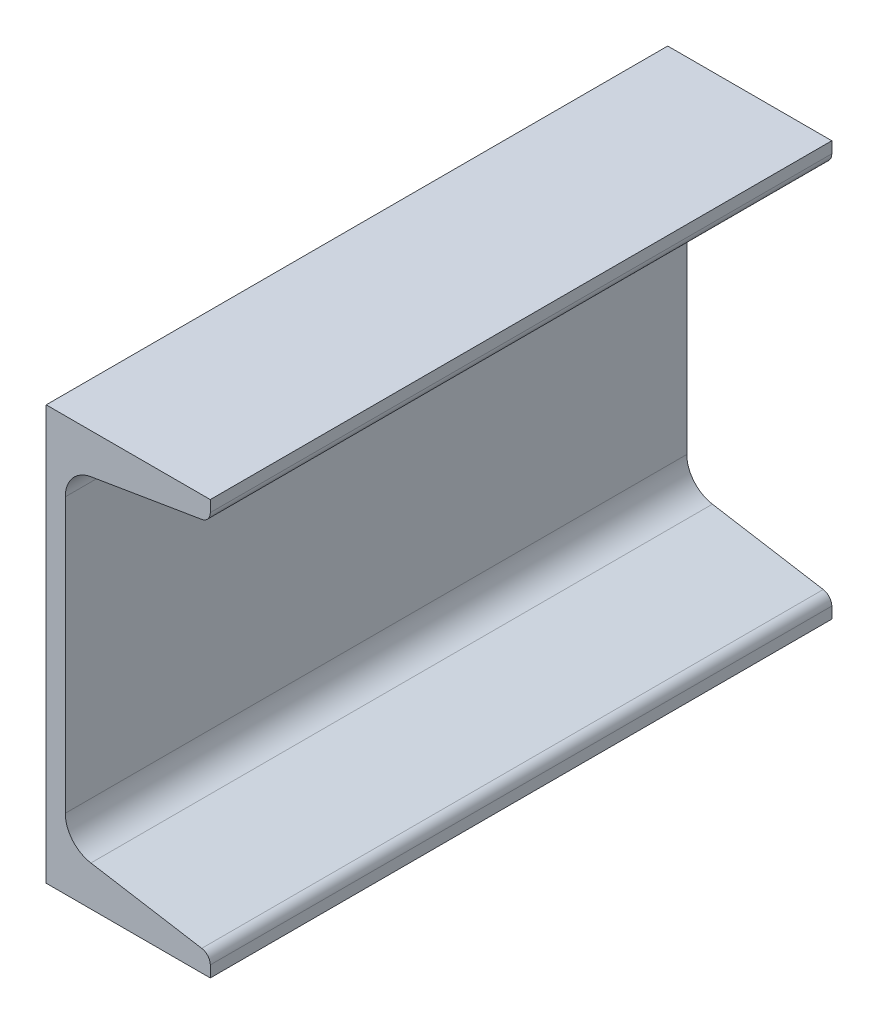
from build123d import *

# Parameters (mm, degrees)
CHANNEL_DEPTH = 76.2


with BuildPart() as part:
    # Profile → Channel (new, symmetric)
    with BuildSketch(Plane.XY):
        with BuildLine():
            Line((0, -50.8), (40.2336, -50.8))
            Line((40.2336, -50.8), (40.2336, -48.018894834))
            ThreePointArc((40.2336, -48.018894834), (39.639694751, -46.398991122), (38.139467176, -45.546859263))
            Line((38.139467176, -45.546859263), (10.955998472, -41.016340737))
            ThreePointArc((10.955998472, -41.016340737), (6.455315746, -38.459945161), (4.6736, -33.600234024))
            Line((4.6736, -33.600234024), (4.6736, 33.600234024))
            ThreePointArc((4.6736, 33.600234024), (6.455315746, 38.459945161), (10.955998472, 41.016340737))
            Line((10.955998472, 41.016340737), (38.139467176, 45.546859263))
            ThreePointArc((38.139467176, 45.546859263), (39.639694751, 46.398991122), (40.2336, 48.018894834))
            Line((40.2336, 48.018894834), (40.2336, 50.8))
            Line((40.2336, 50.8), (0, 50.8))
            Line((0, 50.8), (0, -50.8))
        make_face()
    extrude(amount=CHANNEL_DEPTH, both=True)


solid = part.part
